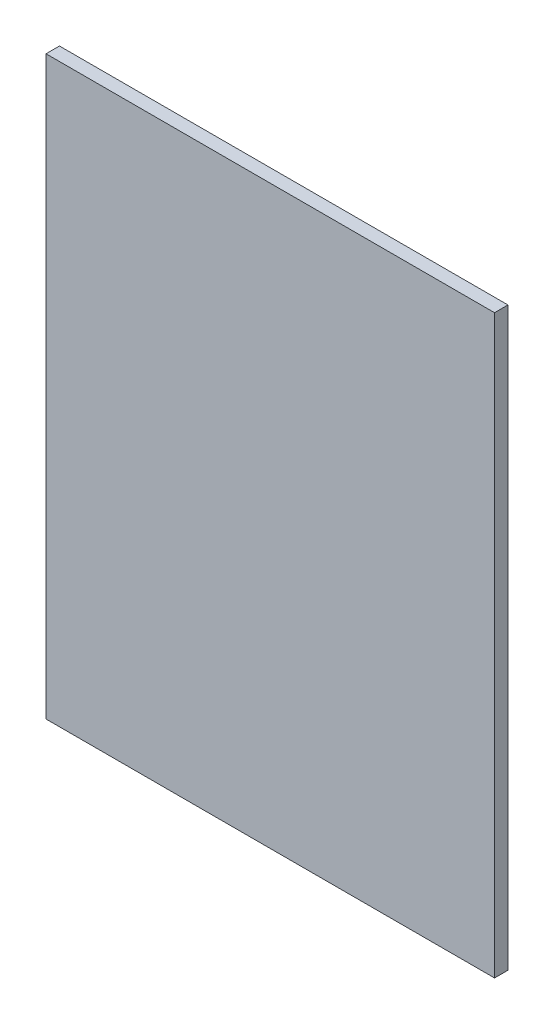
ISO-10303-21;
HEADER;
FILE_DESCRIPTION(('STEP AP214'),'2;1');
FILE_NAME('part.step','',(''),(''),'','','');
FILE_SCHEMA(('AUTOMOTIVE_DESIGN { 1 0 10303 214 1 1 1 1 }'));
ENDSEC;
DATA;
#1=APPLICATION_CONTEXT('core data for automotive mechanical design processes');
#2=APPLICATION_PROTOCOL_DEFINITION('international standard','automotive_design',2000,#1);
#3=PRODUCT_CONTEXT('',#1,'mechanical');
#4=PRODUCT('Part','Part','',(#3));
#5=PRODUCT_RELATED_PRODUCT_CATEGORY('part','',(#4));
#6=PRODUCT_DEFINITION_FORMATION('','',#4);
#7=PRODUCT_DEFINITION_CONTEXT('part definition',#1,'design');
#8=PRODUCT_DEFINITION('design','',#6,#7);
#9=PRODUCT_DEFINITION_SHAPE('','',#8);
#10=(LENGTH_UNIT() NAMED_UNIT(*) SI_UNIT(.MILLI.,.METRE.));
#11=(NAMED_UNIT(*) PLANE_ANGLE_UNIT() SI_UNIT($,.RADIAN.));
#12=(NAMED_UNIT(*) SI_UNIT($,.STERADIAN.) SOLID_ANGLE_UNIT());
#13=UNCERTAINTY_MEASURE_WITH_UNIT(LENGTH_MEASURE(1.E-05),#10,'distance_accuracy_value','');
#14=(GEOMETRIC_REPRESENTATION_CONTEXT(3) GLOBAL_UNCERTAINTY_ASSIGNED_CONTEXT((#13)) GLOBAL_UNIT_ASSIGNED_CONTEXT((#10,
#11,#12)) REPRESENTATION_CONTEXT('',''));
#15=CARTESIAN_POINT('',(0.,0.,0.));
#16=DIRECTION('',(0.,0.,1.));
#17=DIRECTION('',(1.,0.,0.));
#18=AXIS2_PLACEMENT_3D('',#15,#16,#17);
#19=CARTESIAN_POINT('',(53.4,0.,1.59999999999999));
#20=DIRECTION('',(0.,1.,0.));
#21=DIRECTION('',(0.,0.,1.));
#22=AXIS2_PLACEMENT_3D('',#19,#20,#21);
#23=PLANE('',#22);
#24=DIRECTION('',(0.,0.,-1.));
#25=VECTOR('',#24,1.);
#26=CARTESIAN_POINT('',(0.,0.,1.59999999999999));
#27=LINE('',#26,#25);
#28=CARTESIAN_POINT('',(0.,0.,1.59999999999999));
#29=VERTEX_POINT('',#28);
#30=CARTESIAN_POINT('',(0.,0.,0.));
#31=VERTEX_POINT('',#30);
#32=EDGE_CURVE('E115',#29,#31,#27,.T.);
#33=ORIENTED_EDGE('',*,*,#32,.T.);
#34=DIRECTION('',(-1.,0.,0.));
#35=VECTOR('',#34,1.);
#36=CARTESIAN_POINT('',(53.4,0.,0.));
#37=LINE('',#36,#35);
#38=CARTESIAN_POINT('',(53.4,0.,0.));
#39=VERTEX_POINT('',#38);
#40=EDGE_CURVE('E11',#39,#31,#37,.T.);
#41=ORIENTED_EDGE('',*,*,#40,.F.);
#42=DIRECTION('',(0.,0.,-1.));
#43=VECTOR('',#42,1.);
#44=CARTESIAN_POINT('',(53.4,0.,1.59999999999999));
#45=LINE('',#44,#43);
#46=CARTESIAN_POINT('',(53.4,0.,1.59999999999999));
#47=VERTEX_POINT('',#46);
#48=EDGE_CURVE('E94',#47,#39,#45,.T.);
#49=ORIENTED_EDGE('',*,*,#48,.F.);
#50=DIRECTION('',(-1.,0.,0.));
#51=VECTOR('',#50,1.);
#52=CARTESIAN_POINT('',(53.4,0.,1.59999999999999));
#53=LINE('',#52,#51);
#54=EDGE_CURVE('E106',#47,#29,#53,.T.);
#55=ORIENTED_EDGE('',*,*,#54,.T.);
#56=EDGE_LOOP('',(#33,#41,#49,#55));
#57=FACE_BOUND('',#56,.T.);
#58=ADVANCED_FACE('F43',(#57),#23,.F.);
#59=CARTESIAN_POINT('',(53.4,0.,0.));
#60=DIRECTION('',(0.,0.,1.));
#61=DIRECTION('',(1.,0.,0.));
#62=AXIS2_PLACEMENT_3D('',#59,#60,#61);
#63=PLANE('',#62);
#64=DIRECTION('',(0.,1.,0.));
#65=VECTOR('',#64,1.);
#66=CARTESIAN_POINT('',(0.,0.,0.));
#67=LINE('',#66,#65);
#68=CARTESIAN_POINT('',(0.,68.6,0.));
#69=VERTEX_POINT('',#68);
#70=EDGE_CURVE('E99',#31,#69,#67,.T.);
#71=ORIENTED_EDGE('',*,*,#70,.T.);
#72=DIRECTION('',(-1.,0.,0.));
#73=VECTOR('',#72,1.);
#74=CARTESIAN_POINT('',(53.4,68.6,0.));
#75=LINE('',#74,#73);
#76=CARTESIAN_POINT('',(53.4,68.6,0.));
#77=VERTEX_POINT('',#76);
#78=EDGE_CURVE('E55',#77,#69,#75,.T.);
#79=ORIENTED_EDGE('',*,*,#78,.F.);
#80=DIRECTION('',(0.,1.,0.));
#81=VECTOR('',#80,1.);
#82=CARTESIAN_POINT('',(53.4,0.,0.));
#83=LINE('',#82,#81);
#84=EDGE_CURVE('E89',#39,#77,#83,.T.);
#85=ORIENTED_EDGE('',*,*,#84,.F.);
#86=ORIENTED_EDGE('',*,*,#40,.T.);
#87=EDGE_LOOP('',(#71,#79,#85,#86));
#88=FACE_BOUND('',#87,.T.);
#89=ADVANCED_FACE('F98',(#88),#63,.F.);
#90=CARTESIAN_POINT('',(53.4,68.6,0.));
#91=DIRECTION('',(0.,-1.,0.));
#92=DIRECTION('',(0.,0.,-1.));
#93=AXIS2_PLACEMENT_3D('',#90,#91,#92);
#94=PLANE('',#93);
#95=DIRECTION('',(0.,0.,1.));
#96=VECTOR('',#95,1.);
#97=CARTESIAN_POINT('',(0.,68.6,0.));
#98=LINE('',#97,#96);
#99=CARTESIAN_POINT('',(0.,68.6,1.59999999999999));
#100=VERTEX_POINT('',#99);
#101=EDGE_CURVE('E77',#69,#100,#98,.T.);
#102=ORIENTED_EDGE('',*,*,#101,.T.);
#103=DIRECTION('',(-1.,0.,0.));
#104=VECTOR('',#103,1.);
#105=CARTESIAN_POINT('',(53.4,68.6,1.59999999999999));
#106=LINE('',#105,#104);
#107=CARTESIAN_POINT('',(53.4,68.6,1.59999999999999));
#108=VERTEX_POINT('',#107);
#109=EDGE_CURVE('E105',#108,#100,#106,.T.);
#110=ORIENTED_EDGE('',*,*,#109,.F.);
#111=DIRECTION('',(0.,0.,1.));
#112=VECTOR('',#111,1.);
#113=CARTESIAN_POINT('',(53.4,68.6,0.));
#114=LINE('',#113,#112);
#115=EDGE_CURVE('E93',#77,#108,#114,.T.);
#116=ORIENTED_EDGE('',*,*,#115,.F.);
#117=ORIENTED_EDGE('',*,*,#78,.T.);
#118=EDGE_LOOP('',(#102,#110,#116,#117));
#119=FACE_BOUND('',#118,.T.);
#120=ADVANCED_FACE('F104',(#119),#94,.F.);
#121=CARTESIAN_POINT('',(53.4,68.6,1.59999999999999));
#122=DIRECTION('',(0.,0.,-1.));
#123=DIRECTION('',(-1.,0.,0.));
#124=AXIS2_PLACEMENT_3D('',#121,#122,#123);
#125=PLANE('',#124);
#126=DIRECTION('',(0.,-1.,0.));
#127=VECTOR('',#126,1.);
#128=CARTESIAN_POINT('',(0.,68.6,1.59999999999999));
#129=LINE('',#128,#127);
#130=EDGE_CURVE('E81',#100,#29,#129,.T.);
#131=ORIENTED_EDGE('',*,*,#130,.T.);
#132=ORIENTED_EDGE('',*,*,#54,.F.);
#133=DIRECTION('',(0.,-1.,0.));
#134=VECTOR('',#133,1.);
#135=CARTESIAN_POINT('',(53.4,68.6,1.59999999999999));
#136=LINE('',#135,#134);
#137=EDGE_CURVE('E58',#108,#47,#136,.T.);
#138=ORIENTED_EDGE('',*,*,#137,.F.);
#139=ORIENTED_EDGE('',*,*,#109,.T.);
#140=EDGE_LOOP('',(#131,#132,#138,#139));
#141=FACE_BOUND('',#140,.T.);
#142=ADVANCED_FACE('F128',(#141),#125,.F.);
#143=CARTESIAN_POINT('',(53.4,0.,0.));
#144=DIRECTION('',(1.,0.,0.));
#145=DIRECTION('',(0.,0.,-1.));
#146=AXIS2_PLACEMENT_3D('',#143,#144,#145);
#147=PLANE('',#146);
#148=ORIENTED_EDGE('',*,*,#48,.T.);
#149=ORIENTED_EDGE('',*,*,#84,.T.);
#150=ORIENTED_EDGE('',*,*,#115,.T.);
#151=ORIENTED_EDGE('',*,*,#137,.T.);
#152=EDGE_LOOP('',(#148,#149,#150,#151));
#153=FACE_BOUND('',#152,.T.);
#154=ADVANCED_FACE('F91',(#153),#147,.T.);
#155=CARTESIAN_POINT('',(0.,0.,0.));
#156=DIRECTION('',(1.,0.,0.));
#157=DIRECTION('',(0.,0.,-1.));
#158=AXIS2_PLACEMENT_3D('',#155,#156,#157);
#159=PLANE('',#158);
#160=ORIENTED_EDGE('',*,*,#32,.F.);
#161=ORIENTED_EDGE('',*,*,#130,.F.);
#162=ORIENTED_EDGE('',*,*,#101,.F.);
#163=ORIENTED_EDGE('',*,*,#70,.F.);
#164=EDGE_LOOP('',(#160,#161,#162,#163));
#165=FACE_BOUND('',#164,.T.);
#166=ADVANCED_FACE('F129',(#165),#159,.F.);
#167=CLOSED_SHELL('',(#58,#89,#120,#142,#154,#166));
#168=MANIFOLD_SOLID_BREP('B2',#167);
#169=ADVANCED_BREP_SHAPE_REPRESENTATION('',(#18,#168),#14);
#170=SHAPE_DEFINITION_REPRESENTATION(#9,#169);
ENDSEC;
END-ISO-10303-21;
